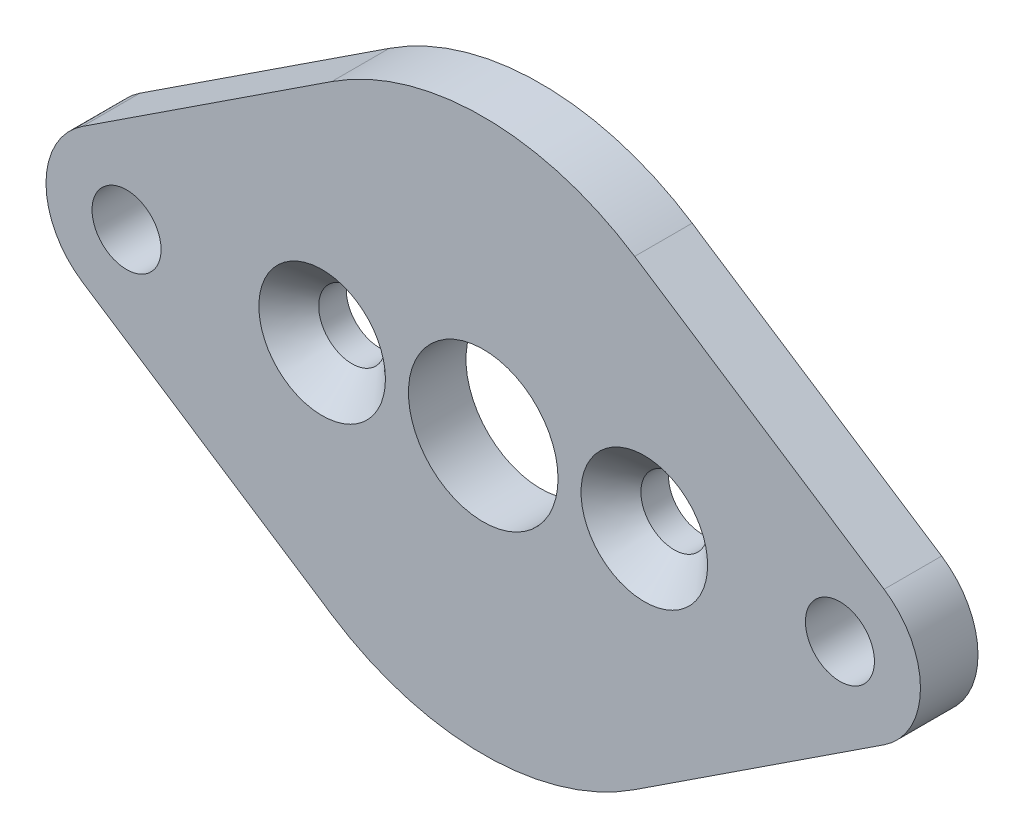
from build123d import *

# Parameters (mm, degrees)
ESQUISSE1_R                        = 1.5
ESQUISSE1_R_2                      = 3.25
BASE_LOSANGE_DEPTH                 = 2.5
FRAISURES_POUR_VIS_M2_5_AT_2_COUNT = 2
FRAISURES_POUR_VIS_M2_5_AT_2_PITCH = 14


with BuildPart() as part:
    # Esquisse1 → Base losange (new body)
    with BuildSketch(Plane.XY):
        with BuildLine():
            Line((-17.419354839, 2.926786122), (-6.580645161, 10.034695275))
            ThreePointArc((-6.580645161, 10.034695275), (0, 12), (6.580645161, 10.034695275))
            Line((6.580645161, 10.034695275), (17.419354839, 2.926786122))
            ThreePointArc((17.419354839, 2.926786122), (19, 0), (17.419354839, -2.926786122))
            Line((17.419354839, -2.926786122), (6.580645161, -10.034695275))
            ThreePointArc((6.580645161, -10.034695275), (0, -12), (-6.580645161, -10.034695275))
            Line((-6.580645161, -10.034695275), (-17.419354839, -2.926786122))
            ThreePointArc((-17.419354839, -2.926786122), (-19, 0), (-17.419354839, 2.926786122))
        make_face()
        with Locations((-15.5, 0)):
            Circle(ESQUISSE1_R, mode=Mode.SUBTRACT)
        Circle(ESQUISSE1_R_2, mode=Mode.SUBTRACT)
        with Locations((15.5, 0)):
            Circle(ESQUISSE1_R, mode=Mode.SUBTRACT)
    extrude(amount=BASE_LOSANGE_DEPTH)

    # Esquisse2 → Fraisures pour vis M2.5 (revolve, cut)
    with BuildSketch(Plane(origin=(-7, 0, 2.5), x_dir=(0, -1, 0), z_dir=(1, 0, 0))):
        Polygon((0, 0), (0, 2.5), (1.45, 2.5), (1.45, 1.3), (2.75, 0), align=None)
    fraisures_pour_vis_m2_5 = revolve(axis=Axis((-7, 0, 8.85), (0, 0, -1)), mode=Mode.SUBTRACT)

    # Fraisures pour vis M2.5 at 2: Fraisures pour vis M2.5 ×2
    with Locations(*[(i * FRAISURES_POUR_VIS_M2_5_AT_2_PITCH, 0, 0) for i in range(1, FRAISURES_POUR_VIS_M2_5_AT_2_COUNT)]):
        add(fraisures_pour_vis_m2_5, mode=Mode.SUBTRACT)


solid = part.part
